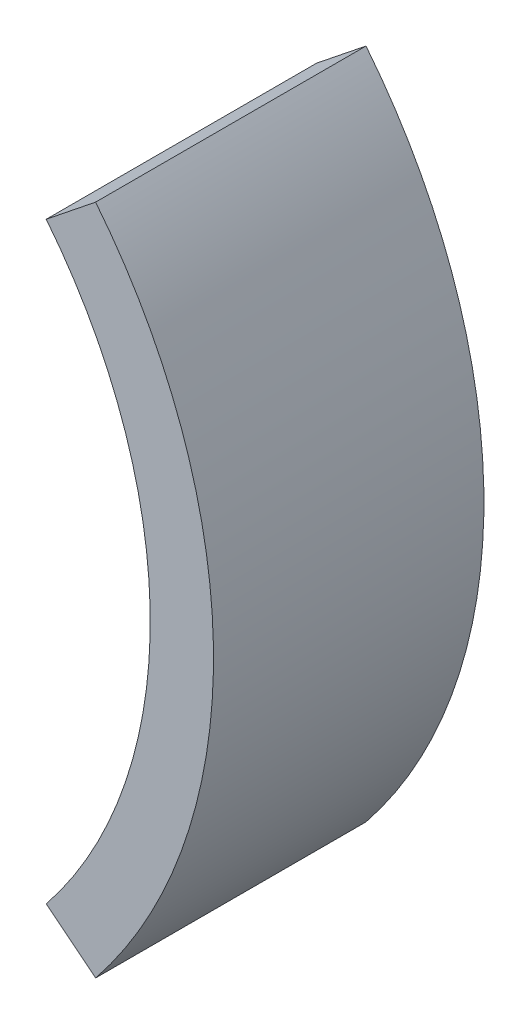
from build123d import *

# Parameters (mm, degrees)
EXTRUDE_THIN1_DEPTH = 8.55


with BuildPart() as part:
    # Sketch1 → Extrude-Thin1 (new, symmetric)
    with BuildSketch(Plane.XY):
        with BuildLine():
            ThreePointArc((23.421208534, 18.746919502), (30, 0), (23.421208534, -18.746919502))
            Line((23.421208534, -18.746919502), (26.544036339, -21.246508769))
            ThreePointArc((26.544036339, -21.246508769), (34, 0), (26.544036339, 21.246508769))
            Line((26.544036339, 21.246508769), (23.421208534, 18.746919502))
        make_face()
    extrude(amount=EXTRUDE_THIN1_DEPTH, both=True)


solid = part.part
